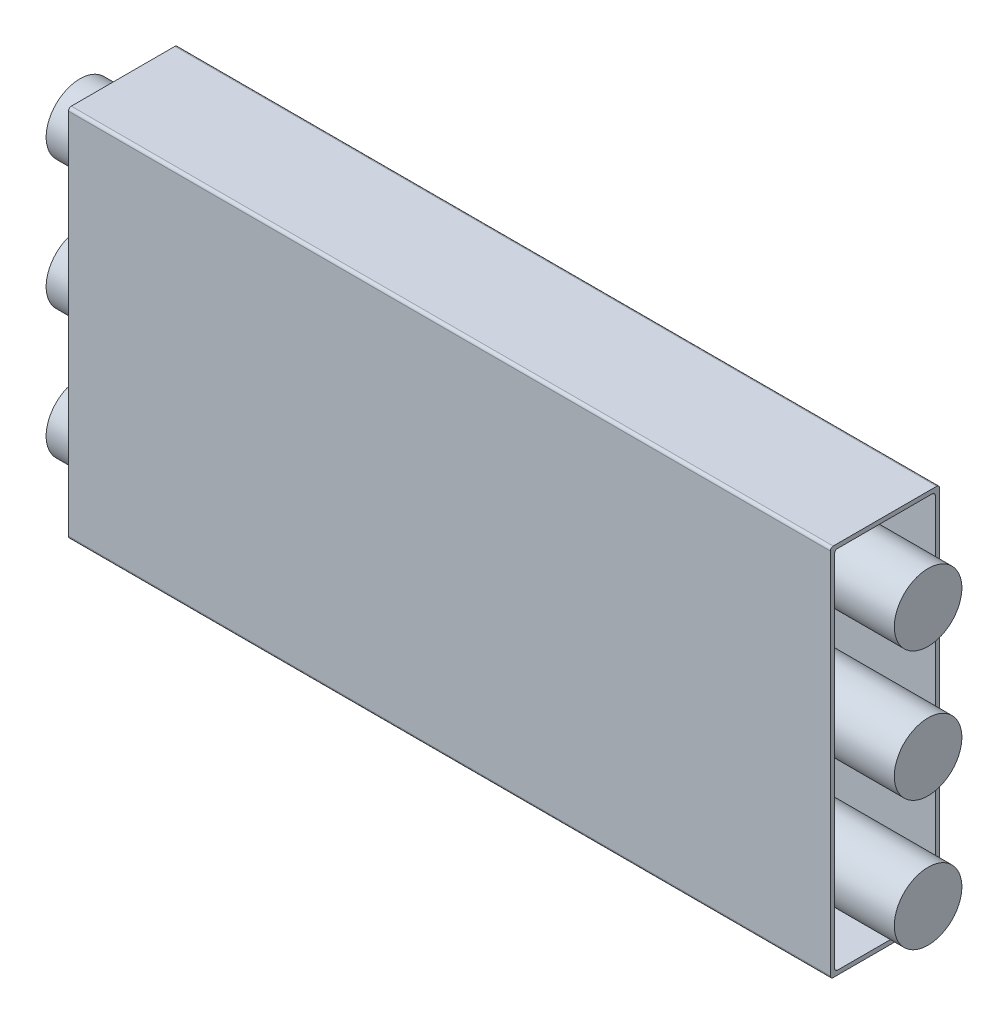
from build123d import *

# Parameters (mm, degrees)
ESQUISSE1_W   = 33
ESQUISSE1_H   = 26
BRUT_DEPTH    = 7.6
ESQUISSE3_W   = 7.6
ESQUISSE3_H   = 26
ESQUISSE3_W_2 = 7
ESQUISSE3_H_2 = 25.4
RAJOUT_DEPTH  = 10
ESQUISSE4_R   = 2.35
FILS_DEPTH    = 13
CONG_1_R      = 0.2


with BuildPart() as part:
    # Esquisse1 → brut (new body)
    with BuildSketch(Plane.XY):
        Rectangle(ESQUISSE1_W, ESQUISSE1_H)
    extrude(amount=BRUT_DEPTH)

    # Esquisse3 → rajout (add)
    with BuildSketch(Plane(origin=(16.5, 0, 0), x_dir=(0, 0, -1), z_dir=(1, 0, 0))):
        with Locations((-3.8, 0)):
            Rectangle(ESQUISSE3_W, ESQUISSE3_H)
        with Locations((-3.8, 0)):
            Rectangle(ESQUISSE3_W_2, ESQUISSE3_H_2, mode=Mode.SUBTRACT)
    rajout = extrude(amount=RAJOUT_DEPTH)

    # Esquisse4 → fils (add)
    with BuildSketch(Plane(origin=(16.5, 0, 0), x_dir=(0, 0, -1), z_dir=(1, 0, 0))):
        with Locations(Location((-3.8, 9, 0), (0, 0, 180))):
            Circle(ESQUISSE4_R)
        with Locations(Location((-3.8, 0, 0), (0, 0, 180))):
            Circle(ESQUISSE4_R)
        with Locations(Location((-3.8, -9, 0), (0, 0, 180))):
            Circle(ESQUISSE4_R)
    fils = extrude(amount=FILS_DEPTH)

    # repet_ fils: rajout, fils across plane
    add(rajout.mirror(Plane(origin=(0, 0, 0), x_dir=(0, 0, 1), z_dir=(1, 0, 0))))
    add(fils.mirror(Plane(origin=(0, 0, 0), x_dir=(0, 0, 1), z_dir=(1, 0, 0))))

    # Cong_1
    cong_1_edges = [part.edges().sort_by_distance(p)[0] for p in [
        (0, -13, 7.6),
        (21.5, -12.7, 7.3),
        (21.5, -12.7, 0.3),
        (21.5, 12.7, 0.3),
        (21.5, 12.7, 7.3),
        (0, -13, 0),
        (0, 13, 0),
        (-21.5, 12.7, 7.3),
        (-21.5, 12.7, 0.3),
        (-21.5, -12.7, 0.3),
        (-21.5, -12.7, 7.3),
        (0, 13, 7.6),
    ]]
    fillet(cong_1_edges, radius=CONG_1_R)


solid = part.part
